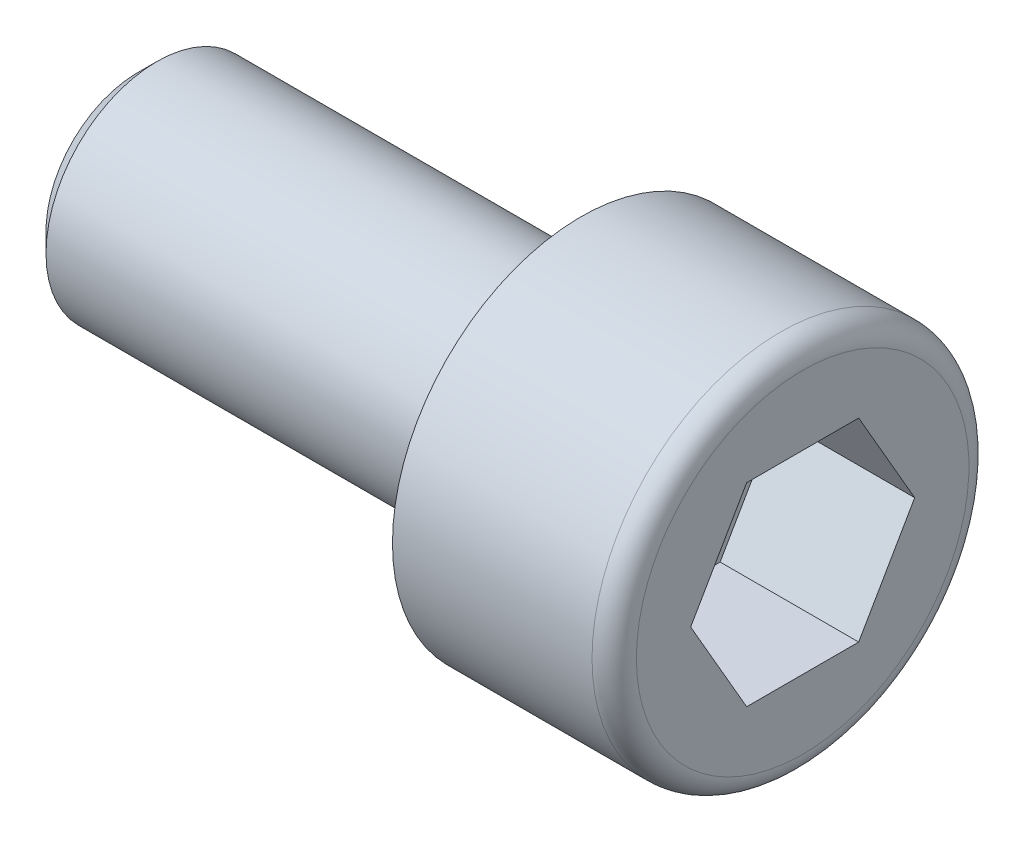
ISO-10303-21;
HEADER;
FILE_DESCRIPTION(('STEP AP214'),'2;1');
FILE_NAME('part.step','',(''),(''),'','','');
FILE_SCHEMA(('AUTOMOTIVE_DESIGN { 1 0 10303 214 1 1 1 1 }'));
ENDSEC;
DATA;
#1=APPLICATION_CONTEXT('core data for automotive mechanical design processes');
#2=APPLICATION_PROTOCOL_DEFINITION('international standard','automotive_design',2000,#1);
#3=PRODUCT_CONTEXT('',#1,'mechanical');
#4=PRODUCT('Part','Part','',(#3));
#5=PRODUCT_RELATED_PRODUCT_CATEGORY('part','',(#4));
#6=PRODUCT_DEFINITION_FORMATION('','',#4);
#7=PRODUCT_DEFINITION_CONTEXT('part definition',#1,'design');
#8=PRODUCT_DEFINITION('design','',#6,#7);
#9=PRODUCT_DEFINITION_SHAPE('','',#8);
#10=(LENGTH_UNIT() NAMED_UNIT(*) SI_UNIT(.MILLI.,.METRE.));
#11=(NAMED_UNIT(*) PLANE_ANGLE_UNIT() SI_UNIT($,.RADIAN.));
#12=(NAMED_UNIT(*) SI_UNIT($,.STERADIAN.) SOLID_ANGLE_UNIT());
#13=UNCERTAINTY_MEASURE_WITH_UNIT(LENGTH_MEASURE(1.E-05),#10,'distance_accuracy_value','');
#14=(GEOMETRIC_REPRESENTATION_CONTEXT(3) GLOBAL_UNCERTAINTY_ASSIGNED_CONTEXT((#13)) GLOBAL_UNIT_ASSIGNED_CONTEXT((#10,
#11,#12)) REPRESENTATION_CONTEXT('',''));
#15=CARTESIAN_POINT('',(0.,0.,0.));
#16=DIRECTION('',(0.,0.,1.));
#17=DIRECTION('',(1.,0.,0.));
#18=AXIS2_PLACEMENT_3D('',#15,#16,#17);
#19=CARTESIAN_POINT('',(-30.,0.,0.));
#20=DIRECTION('',(-1.,0.,0.));
#21=DIRECTION('',(0.,0.,1.));
#22=AXIS2_PLACEMENT_3D('',#19,#20,#21);
#23=CYLINDRICAL_SURFACE('',#22,2.);
#24=CARTESIAN_POINT('',(-7.65,0.,0.));
#25=DIRECTION('',(1.,0.,0.));
#26=DIRECTION('',(0.,0.,-1.));
#27=AXIS2_PLACEMENT_3D('',#24,#25,#26);
#28=CIRCLE('',#27,2.);
#29=CARTESIAN_POINT('',(-7.65,0.,-2.));
#30=VERTEX_POINT('',#29);
#31=EDGE_CURVE('E11',#30,#30,#28,.T.);
#32=ORIENTED_EDGE('',*,*,#31,.T.);
#33=EDGE_LOOP('',(#32));
#34=FACE_BOUND('',#33,.T.);
#35=CARTESIAN_POINT('',(0.,0.,0.));
#36=DIRECTION('',(-1.,0.,0.));
#37=DIRECTION('',(0.,0.,1.));
#38=AXIS2_PLACEMENT_3D('',#35,#36,#37);
#39=CIRCLE('',#38,2.);
#40=CARTESIAN_POINT('',(0.,0.,2.));
#41=VERTEX_POINT('',#40);
#42=EDGE_CURVE('E427',#41,#41,#39,.T.);
#43=ORIENTED_EDGE('',*,*,#42,.T.);
#44=EDGE_LOOP('',(#43));
#45=FACE_BOUND('',#44,.T.);
#46=ADVANCED_FACE('F348',(#34,#45),#23,.T.);
#47=CARTESIAN_POINT('',(-8.,0.,0.));
#48=DIRECTION('',(1.,0.,0.));
#49=DIRECTION('',(0.,0.,-1.));
#50=AXIS2_PLACEMENT_3D('',#47,#48,#49);
#51=PLANE('',#50);
#52=CARTESIAN_POINT('',(-8.,0.,0.));
#53=DIRECTION('',(1.,0.,0.));
#54=DIRECTION('',(0.,0.,-1.));
#55=AXIS2_PLACEMENT_3D('',#52,#53,#54);
#56=CIRCLE('',#55,1.65);
#57=CARTESIAN_POINT('',(-8.,0.,-1.65));
#58=VERTEX_POINT('',#57);
#59=EDGE_CURVE('E355',#58,#58,#56,.F.);
#60=ORIENTED_EDGE('',*,*,#59,.T.);
#61=EDGE_LOOP('',(#60));
#62=FACE_BOUND('',#61,.T.);
#63=ADVANCED_FACE('F448',(#62),#51,.F.);
#64=CARTESIAN_POINT('',(4.,3.,0.));
#65=DIRECTION('',(-1.,0.,0.));
#66=DIRECTION('',(0.,0.,1.));
#67=AXIS2_PLACEMENT_3D('',#64,#65,#66);
#68=PLANE('',#67);
#69=CARTESIAN_POINT('',(4.,0.,0.));
#70=DIRECTION('',(-1.,0.,0.));
#71=DIRECTION('',(0.,0.,1.));
#72=AXIS2_PLACEMENT_3D('',#69,#70,#71);
#73=CIRCLE('',#72,3.);
#74=CARTESIAN_POINT('',(4.,0.,3.));
#75=VERTEX_POINT('',#74);
#76=EDGE_CURVE('E416',#75,#75,#73,.T.);
#77=ORIENTED_EDGE('',*,*,#76,.F.);
#78=EDGE_LOOP('',(#77));
#79=FACE_BOUND('',#78,.T.);
#80=DIRECTION('',(0.,0.866025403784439,0.5));
#81=VECTOR('',#80,1.);
#82=CARTESIAN_POINT('',(4.,1.375,2.81458256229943));
#83=LINE('',#82,#81);
#84=CARTESIAN_POINT('',(4.,-1.75,1.01036297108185));
#85=VERTEX_POINT('',#84);
#86=CARTESIAN_POINT('',(4.,0.,2.02072594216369));
#87=VERTEX_POINT('',#86);
#88=EDGE_CURVE('E362',#85,#87,#83,.T.);
#89=ORIENTED_EDGE('',*,*,#88,.T.);
#90=DIRECTION('',(0.,0.866025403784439,-0.5));
#91=VECTOR('',#90,1.);
#92=CARTESIAN_POINT('',(4.,3.125,0.216506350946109));
#93=LINE('',#92,#91);
#94=CARTESIAN_POINT('',(4.,1.75,1.01036297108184));
#95=VERTEX_POINT('',#94);
#96=EDGE_CURVE('E444',#87,#95,#93,.T.);
#97=ORIENTED_EDGE('',*,*,#96,.T.);
#98=DIRECTION('',(0.,0.,-1.));
#99=VECTOR('',#98,1.);
#100=CARTESIAN_POINT('',(4.,1.75,0.));
#101=LINE('',#100,#99);
#102=CARTESIAN_POINT('',(4.,1.75,-1.01036297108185));
#103=VERTEX_POINT('',#102);
#104=EDGE_CURVE('E442',#95,#103,#101,.T.);
#105=ORIENTED_EDGE('',*,*,#104,.T.);
#106=DIRECTION('',(0.,-0.866025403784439,-0.5));
#107=VECTOR('',#106,1.);
#108=CARTESIAN_POINT('',(4.,3.125,-0.21650635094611));
#109=LINE('',#108,#107);
#110=CARTESIAN_POINT('',(4.,0.,-2.02072594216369));
#111=VERTEX_POINT('',#110);
#112=EDGE_CURVE('E440',#103,#111,#109,.T.);
#113=ORIENTED_EDGE('',*,*,#112,.T.);
#114=DIRECTION('',(0.,-0.866025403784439,0.5));
#115=VECTOR('',#114,1.);
#116=CARTESIAN_POINT('',(4.,1.375,-2.81458256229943));
#117=LINE('',#116,#115);
#118=CARTESIAN_POINT('',(4.,-1.75,-1.01036297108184));
#119=VERTEX_POINT('',#118);
#120=EDGE_CURVE('E401',#111,#119,#117,.T.);
#121=ORIENTED_EDGE('',*,*,#120,.T.);
#122=DIRECTION('',(0.,0.,1.));
#123=VECTOR('',#122,1.);
#124=CARTESIAN_POINT('',(4.,-1.75,0.));
#125=LINE('',#124,#123);
#126=EDGE_CURVE('E398',#119,#85,#125,.T.);
#127=ORIENTED_EDGE('',*,*,#126,.T.);
#128=EDGE_LOOP('',(#89,#97,#105,#113,#121,#127));
#129=FACE_BOUND('',#128,.T.);
#130=ADVANCED_FACE('F399',(#79,#129),#68,.F.);
#131=CARTESIAN_POINT('',(3.6,0.,0.));
#132=DIRECTION('',(-1.,0.,0.));
#133=DIRECTION('',(0.,0.,1.));
#134=AXIS2_PLACEMENT_3D('',#131,#132,#133);
#135=TOROIDAL_SURFACE('',#134,3.,0.4);
#136=CARTESIAN_POINT('',(3.6,0.,0.));
#137=DIRECTION('',(-1.,0.,0.));
#138=DIRECTION('',(0.,0.,1.));
#139=AXIS2_PLACEMENT_3D('',#136,#137,#138);
#140=CIRCLE('',#139,3.4);
#141=CARTESIAN_POINT('',(3.6,0.,3.4));
#142=VERTEX_POINT('',#141);
#143=EDGE_CURVE('E434',#142,#142,#140,.T.);
#144=ORIENTED_EDGE('',*,*,#143,.F.);
#145=EDGE_LOOP('',(#144));
#146=FACE_BOUND('',#145,.T.);
#147=ORIENTED_EDGE('',*,*,#76,.T.);
#148=EDGE_LOOP('',(#147));
#149=FACE_BOUND('',#148,.T.);
#150=ADVANCED_FACE('F479',(#146,#149),#135,.T.);
#151=CARTESIAN_POINT('',(-30.,0.,0.));
#152=DIRECTION('',(-1.,0.,0.));
#153=DIRECTION('',(0.,0.,1.));
#154=AXIS2_PLACEMENT_3D('',#151,#152,#153);
#155=CYLINDRICAL_SURFACE('',#154,3.4);
#156=CARTESIAN_POINT('',(0.,0.,0.));
#157=DIRECTION('',(-1.,0.,0.));
#158=DIRECTION('',(0.,0.,1.));
#159=AXIS2_PLACEMENT_3D('',#156,#157,#158);
#160=CIRCLE('',#159,3.4);
#161=CARTESIAN_POINT('',(0.,0.,3.4));
#162=VERTEX_POINT('',#161);
#163=EDGE_CURVE('E430',#162,#162,#160,.T.);
#164=ORIENTED_EDGE('',*,*,#163,.F.);
#165=EDGE_LOOP('',(#164));
#166=FACE_BOUND('',#165,.T.);
#167=ORIENTED_EDGE('',*,*,#143,.T.);
#168=EDGE_LOOP('',(#167));
#169=FACE_BOUND('',#168,.T.);
#170=ADVANCED_FACE('F473',(#166,#169),#155,.T.);
#171=CARTESIAN_POINT('',(0.,2.,0.));
#172=DIRECTION('',(1.,0.,0.));
#173=DIRECTION('',(0.,0.,-1.));
#174=AXIS2_PLACEMENT_3D('',#171,#172,#173);
#175=PLANE('',#174);
#176=ORIENTED_EDGE('',*,*,#42,.F.);
#177=EDGE_LOOP('',(#176));
#178=FACE_BOUND('',#177,.T.);
#179=ORIENTED_EDGE('',*,*,#163,.T.);
#180=EDGE_LOOP('',(#179));
#181=FACE_BOUND('',#180,.T.);
#182=ADVANCED_FACE('F469',(#178,#181),#175,.F.);
#183=CARTESIAN_POINT('',(1.5,1.75,1.01036297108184));
#184=DIRECTION('',(0.,0.5,0.866025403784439));
#185=DIRECTION('',(0.,-0.866025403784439,0.5));
#186=AXIS2_PLACEMENT_3D('',#183,#184,#185);
#187=PLANE('',#186);
#188=DIRECTION('',(0.,-0.866025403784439,0.5));
#189=VECTOR('',#188,1.);
#190=CARTESIAN_POINT('',(1.5,1.75,1.01036297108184));
#191=LINE('',#190,#189);
#192=CARTESIAN_POINT('',(1.5,1.75,1.01036297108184));
#193=VERTEX_POINT('',#192);
#194=CARTESIAN_POINT('',(1.5,0.,2.02072594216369));
#195=VERTEX_POINT('',#194);
#196=EDGE_CURVE('E535',#193,#195,#191,.T.);
#197=ORIENTED_EDGE('',*,*,#196,.F.);
#198=DIRECTION('',(1.,0.,0.));
#199=VECTOR('',#198,1.);
#200=CARTESIAN_POINT('',(1.5,1.75,1.01036297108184));
#201=LINE('',#200,#199);
#202=EDGE_CURVE('E431',#193,#95,#201,.T.);
#203=ORIENTED_EDGE('',*,*,#202,.T.);
#204=ORIENTED_EDGE('',*,*,#96,.F.);
#205=DIRECTION('',(1.,0.,0.));
#206=VECTOR('',#205,1.);
#207=CARTESIAN_POINT('',(1.5,0.,2.02072594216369));
#208=LINE('',#207,#206);
#209=EDGE_CURVE('E414',#195,#87,#208,.T.);
#210=ORIENTED_EDGE('',*,*,#209,.F.);
#211=EDGE_LOOP('',(#197,#203,#204,#210));
#212=FACE_BOUND('',#211,.T.);
#213=ADVANCED_FACE('F472',(#212),#187,.F.);
#214=CARTESIAN_POINT('',(1.5,1.75,-1.01036297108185));
#215=DIRECTION('',(0.,1.,0.));
#216=DIRECTION('',(0.,0.,1.));
#217=AXIS2_PLACEMENT_3D('',#214,#215,#216);
#218=PLANE('',#217);
#219=DIRECTION('',(0.,0.,1.));
#220=VECTOR('',#219,1.);
#221=CARTESIAN_POINT('',(1.5,1.75,-1.01036297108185));
#222=LINE('',#221,#220);
#223=CARTESIAN_POINT('',(1.5,1.75,-1.01036297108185));
#224=VERTEX_POINT('',#223);
#225=EDGE_CURVE('E370',#224,#193,#222,.T.);
#226=ORIENTED_EDGE('',*,*,#225,.F.);
#227=DIRECTION('',(1.,0.,0.));
#228=VECTOR('',#227,1.);
#229=CARTESIAN_POINT('',(1.5,1.75,-1.01036297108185));
#230=LINE('',#229,#228);
#231=EDGE_CURVE('E516',#224,#103,#230,.T.);
#232=ORIENTED_EDGE('',*,*,#231,.T.);
#233=ORIENTED_EDGE('',*,*,#104,.F.);
#234=ORIENTED_EDGE('',*,*,#202,.F.);
#235=EDGE_LOOP('',(#226,#232,#233,#234));
#236=FACE_BOUND('',#235,.T.);
#237=ADVANCED_FACE('F496',(#236),#218,.F.);
#238=CARTESIAN_POINT('',(1.5,0.,-2.02072594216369));
#239=DIRECTION('',(0.,0.5,-0.866025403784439));
#240=DIRECTION('',(0.,0.866025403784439,0.5));
#241=AXIS2_PLACEMENT_3D('',#238,#239,#240);
#242=PLANE('',#241);
#243=DIRECTION('',(0.,0.866025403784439,0.5));
#244=VECTOR('',#243,1.);
#245=CARTESIAN_POINT('',(1.5,0.,-2.02072594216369));
#246=LINE('',#245,#244);
#247=CARTESIAN_POINT('',(1.5,0.,-2.02072594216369));
#248=VERTEX_POINT('',#247);
#249=EDGE_CURVE('E519',#248,#224,#246,.T.);
#250=ORIENTED_EDGE('',*,*,#249,.F.);
#251=DIRECTION('',(1.,0.,0.));
#252=VECTOR('',#251,1.);
#253=CARTESIAN_POINT('',(1.5,0.,-2.02072594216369));
#254=LINE('',#253,#252);
#255=EDGE_CURVE('E422',#248,#111,#254,.T.);
#256=ORIENTED_EDGE('',*,*,#255,.T.);
#257=ORIENTED_EDGE('',*,*,#112,.F.);
#258=ORIENTED_EDGE('',*,*,#231,.F.);
#259=EDGE_LOOP('',(#250,#256,#257,#258));
#260=FACE_BOUND('',#259,.T.);
#261=ADVANCED_FACE('F505',(#260),#242,.F.);
#262=CARTESIAN_POINT('',(1.5,-1.75,-1.01036297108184));
#263=DIRECTION('',(0.,-0.5,-0.866025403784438));
#264=DIRECTION('',(0.,0.866025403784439,-0.5));
#265=AXIS2_PLACEMENT_3D('',#262,#263,#264);
#266=PLANE('',#265);
#267=DIRECTION('',(0.,0.866025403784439,-0.5));
#268=VECTOR('',#267,1.);
#269=CARTESIAN_POINT('',(1.5,-1.75,-1.01036297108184));
#270=LINE('',#269,#268);
#271=CARTESIAN_POINT('',(1.5,-1.75,-1.01036297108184));
#272=VERTEX_POINT('',#271);
#273=EDGE_CURVE('E521',#272,#248,#270,.T.);
#274=ORIENTED_EDGE('',*,*,#273,.F.);
#275=DIRECTION('',(1.,0.,0.));
#276=VECTOR('',#275,1.);
#277=CARTESIAN_POINT('',(1.5,-1.75,-1.01036297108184));
#278=LINE('',#277,#276);
#279=EDGE_CURVE('E420',#272,#119,#278,.T.);
#280=ORIENTED_EDGE('',*,*,#279,.T.);
#281=ORIENTED_EDGE('',*,*,#120,.F.);
#282=ORIENTED_EDGE('',*,*,#255,.F.);
#283=EDGE_LOOP('',(#274,#280,#281,#282));
#284=FACE_BOUND('',#283,.T.);
#285=ADVANCED_FACE('F502',(#284),#266,.F.);
#286=CARTESIAN_POINT('',(1.5,-1.75,1.01036297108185));
#287=DIRECTION('',(0.,-1.,0.));
#288=DIRECTION('',(0.,0.,-1.));
#289=AXIS2_PLACEMENT_3D('',#286,#287,#288);
#290=PLANE('',#289);
#291=DIRECTION('',(0.,0.,-1.));
#292=VECTOR('',#291,1.);
#293=CARTESIAN_POINT('',(1.5,-1.75,1.01036297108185));
#294=LINE('',#293,#292);
#295=CARTESIAN_POINT('',(1.5,-1.75,1.01036297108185));
#296=VERTEX_POINT('',#295);
#297=EDGE_CURVE('E419',#296,#272,#294,.T.);
#298=ORIENTED_EDGE('',*,*,#297,.F.);
#299=DIRECTION('',(1.,0.,0.));
#300=VECTOR('',#299,1.);
#301=CARTESIAN_POINT('',(1.5,-1.75,1.01036297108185));
#302=LINE('',#301,#300);
#303=EDGE_CURVE('E411',#296,#85,#302,.T.);
#304=ORIENTED_EDGE('',*,*,#303,.T.);
#305=ORIENTED_EDGE('',*,*,#126,.F.);
#306=ORIENTED_EDGE('',*,*,#279,.F.);
#307=EDGE_LOOP('',(#298,#304,#305,#306));
#308=FACE_BOUND('',#307,.T.);
#309=ADVANCED_FACE('F418',(#308),#290,.F.);
#310=CARTESIAN_POINT('',(1.5,0.,2.02072594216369));
#311=DIRECTION('',(0.,-0.5,0.866025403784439));
#312=DIRECTION('',(0.,-0.866025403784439,-0.5));
#313=AXIS2_PLACEMENT_3D('',#310,#311,#312);
#314=PLANE('',#313);
#315=DIRECTION('',(0.,-0.866025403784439,-0.5));
#316=VECTOR('',#315,1.);
#317=CARTESIAN_POINT('',(1.5,0.,2.02072594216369));
#318=LINE('',#317,#316);
#319=EDGE_CURVE('E531',#195,#296,#318,.T.);
#320=ORIENTED_EDGE('',*,*,#319,.F.);
#321=ORIENTED_EDGE('',*,*,#209,.T.);
#322=ORIENTED_EDGE('',*,*,#88,.F.);
#323=ORIENTED_EDGE('',*,*,#303,.F.);
#324=EDGE_LOOP('',(#320,#321,#322,#323));
#325=FACE_BOUND('',#324,.T.);
#326=ADVANCED_FACE('F410',(#325),#314,.F.);
#327=CARTESIAN_POINT('',(1.5,1.75,0.));
#328=DIRECTION('',(-1.,0.,0.));
#329=DIRECTION('',(0.,0.,1.));
#330=AXIS2_PLACEMENT_3D('',#327,#328,#329);
#331=PLANE('',#330);
#332=ORIENTED_EDGE('',*,*,#225,.T.);
#333=ORIENTED_EDGE('',*,*,#196,.T.);
#334=ORIENTED_EDGE('',*,*,#319,.T.);
#335=ORIENTED_EDGE('',*,*,#297,.T.);
#336=ORIENTED_EDGE('',*,*,#273,.T.);
#337=ORIENTED_EDGE('',*,*,#249,.T.);
#338=EDGE_LOOP('',(#332,#333,#334,#335,#336,#337));
#339=FACE_BOUND('',#338,.T.);
#340=ADVANCED_FACE('F452',(#339),#331,.F.);
#341=CARTESIAN_POINT('',(-8.,0.,0.));
#342=DIRECTION('',(1.,0.,0.));
#343=DIRECTION('',(0.,0.,-1.));
#344=AXIS2_PLACEMENT_3D('',#341,#342,#343);
#345=CONICAL_SURFACE('',#344,1.65,0.785398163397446);
#346=ORIENTED_EDGE('',*,*,#31,.F.);
#347=EDGE_LOOP('',(#346));
#348=FACE_BOUND('',#347,.T.);
#349=ORIENTED_EDGE('',*,*,#59,.F.);
#350=EDGE_LOOP('',(#349));
#351=FACE_BOUND('',#350,.T.);
#352=ADVANCED_FACE('F450',(#348,#351),#345,.T.);
#353=CLOSED_SHELL('',(#46,#63,#130,#150,#170,#182,#213,#237,#261,#285,#309,#326,#340,#352));
#354=MANIFOLD_SOLID_BREP('B2',#353);
#355=ADVANCED_BREP_SHAPE_REPRESENTATION('',(#18,#354),#14);
#356=SHAPE_DEFINITION_REPRESENTATION(#9,#355);
ENDSEC;
END-ISO-10303-21;
